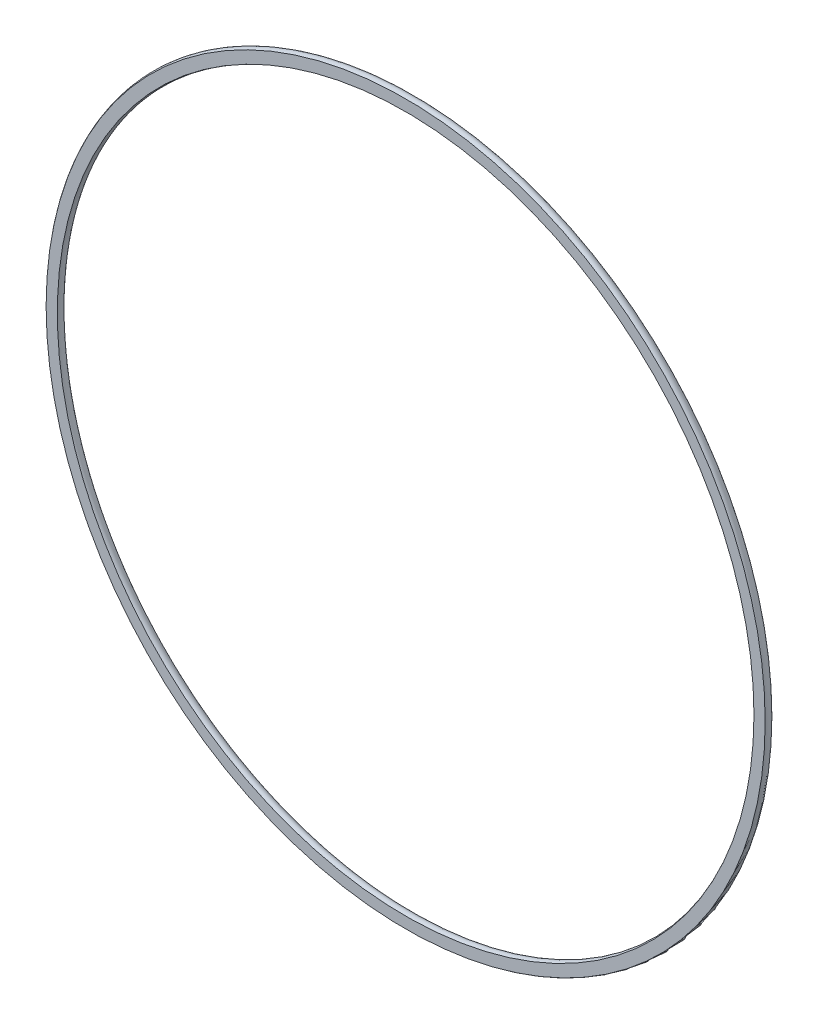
ISO-10303-21;
HEADER;
FILE_DESCRIPTION(('STEP AP214'),'2;1');
FILE_NAME('part.step','',(''),(''),'','','');
FILE_SCHEMA(('AUTOMOTIVE_DESIGN { 1 0 10303 214 1 1 1 1 }'));
ENDSEC;
DATA;
#1=APPLICATION_CONTEXT('core data for automotive mechanical design processes');
#2=APPLICATION_PROTOCOL_DEFINITION('international standard','automotive_design',2000,#1);
#3=PRODUCT_CONTEXT('',#1,'mechanical');
#4=PRODUCT('Part','Part','',(#3));
#5=PRODUCT_RELATED_PRODUCT_CATEGORY('part','',(#4));
#6=PRODUCT_DEFINITION_FORMATION('','',#4);
#7=PRODUCT_DEFINITION_CONTEXT('part definition',#1,'design');
#8=PRODUCT_DEFINITION('design','',#6,#7);
#9=PRODUCT_DEFINITION_SHAPE('','',#8);
#10=(LENGTH_UNIT() NAMED_UNIT(*) SI_UNIT(.MILLI.,.METRE.));
#11=(NAMED_UNIT(*) PLANE_ANGLE_UNIT() SI_UNIT($,.RADIAN.));
#12=(NAMED_UNIT(*) SI_UNIT($,.STERADIAN.) SOLID_ANGLE_UNIT());
#13=UNCERTAINTY_MEASURE_WITH_UNIT(LENGTH_MEASURE(1.E-05),#10,'distance_accuracy_value','');
#14=(GEOMETRIC_REPRESENTATION_CONTEXT(3) GLOBAL_UNCERTAINTY_ASSIGNED_CONTEXT((#13)) GLOBAL_UNIT_ASSIGNED_CONTEXT((#10,
#11,#12)) REPRESENTATION_CONTEXT('',''));
#15=CARTESIAN_POINT('',(0.,0.,0.));
#16=DIRECTION('',(0.,0.,1.));
#17=DIRECTION('',(1.,0.,0.));
#18=AXIS2_PLACEMENT_3D('',#15,#16,#17);
#19=CARTESIAN_POINT('',(0.,0.,0.));
#20=DIRECTION('',(0.,0.,1.));
#21=DIRECTION('',(1.,0.,0.));
#22=AXIS2_PLACEMENT_3D('',#19,#20,#21);
#23=TOROIDAL_SURFACE('',#22,96.8121,1.76529999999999);
#24=CARTESIAN_POINT('',(0.,0.,0.8763));
#25=DIRECTION('',(0.,0.,1.));
#26=DIRECTION('',(1.,0.,0.));
#27=AXIS2_PLACEMENT_3D('',#24,#25,#26);
#28=CIRCLE('',#27,95.2796567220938);
#29=CARTESIAN_POINT('',(95.2796567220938,0.,0.8763));
#30=VERTEX_POINT('',#29);
#31=EDGE_CURVE('E44',#30,#30,#28,.F.);
#32=ORIENTED_EDGE('',*,*,#31,.F.);
#33=EDGE_LOOP('',(#32));
#34=FACE_BOUND('',#33,.T.);
#35=CARTESIAN_POINT('',(0.,0.,0.8763));
#36=DIRECTION('',(0.,0.,-1.));
#37=DIRECTION('',(-1.,0.,0.));
#38=AXIS2_PLACEMENT_3D('',#35,#36,#37);
#39=CIRCLE('',#38,98.3445432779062);
#40=CARTESIAN_POINT('',(-98.3445432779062,0.,0.8763));
#41=VERTEX_POINT('',#40);
#42=EDGE_CURVE('E10',#41,#41,#39,.F.);
#43=ORIENTED_EDGE('',*,*,#42,.F.);
#44=EDGE_LOOP('',(#43));
#45=FACE_BOUND('',#44,.T.);
#46=ADVANCED_FACE('F37',(#34,#45),#23,.T.);
#47=CARTESIAN_POINT('',(0.,0.,0.8763));
#48=DIRECTION('',(0.,0.,-1.));
#49=DIRECTION('',(-1.,0.,0.));
#50=AXIS2_PLACEMENT_3D('',#47,#48,#49);
#51=PLANE('',#50);
#52=ORIENTED_EDGE('',*,*,#42,.T.);
#53=EDGE_LOOP('',(#52));
#54=FACE_BOUND('',#53,.T.);
#55=ORIENTED_EDGE('',*,*,#31,.T.);
#56=EDGE_LOOP('',(#55));
#57=FACE_BOUND('',#56,.T.);
#58=ADVANCED_FACE('F51',(#54,#57),#51,.F.);
#59=CLOSED_SHELL('',(#46,#58));
#60=MANIFOLD_SOLID_BREP('B2',#59);
#61=ADVANCED_BREP_SHAPE_REPRESENTATION('',(#18,#60),#14);
#62=SHAPE_DEFINITION_REPRESENTATION(#9,#61);
ENDSEC;
END-ISO-10303-21;
